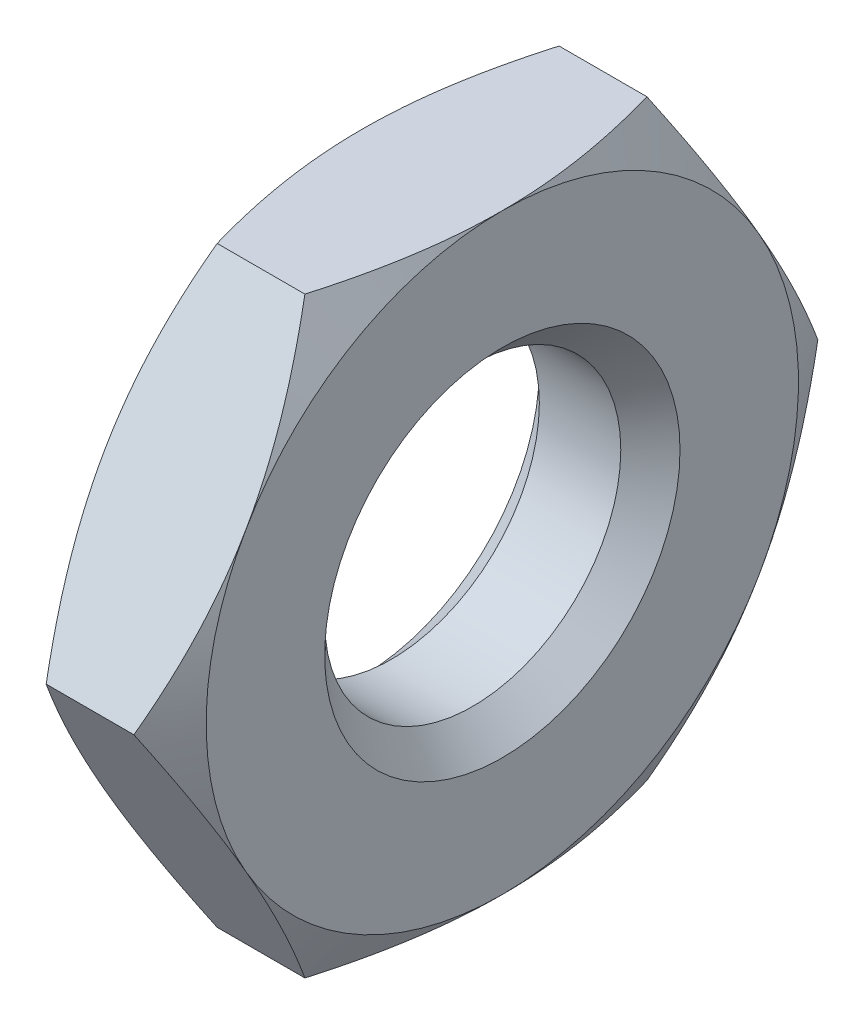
ISO-10303-21;
HEADER;
FILE_DESCRIPTION(('STEP AP214'),'2;1');
FILE_NAME('part.step','',(''),(''),'','','');
FILE_SCHEMA(('AUTOMOTIVE_DESIGN { 1 0 10303 214 1 1 1 1 }'));
ENDSEC;
DATA;
#1=APPLICATION_CONTEXT('core data for automotive mechanical design processes');
#2=APPLICATION_PROTOCOL_DEFINITION('international standard','automotive_design',2000,#1);
#3=PRODUCT_CONTEXT('',#1,'mechanical');
#4=PRODUCT('Part','Part','',(#3));
#5=PRODUCT_RELATED_PRODUCT_CATEGORY('part','',(#4));
#6=PRODUCT_DEFINITION_FORMATION('','',#4);
#7=PRODUCT_DEFINITION_CONTEXT('part definition',#1,'design');
#8=PRODUCT_DEFINITION('design','',#6,#7);
#9=PRODUCT_DEFINITION_SHAPE('','',#8);
#10=(LENGTH_UNIT() NAMED_UNIT(*) SI_UNIT(.MILLI.,.METRE.));
#11=(NAMED_UNIT(*) PLANE_ANGLE_UNIT() SI_UNIT($,.RADIAN.));
#12=(NAMED_UNIT(*) SI_UNIT($,.STERADIAN.) SOLID_ANGLE_UNIT());
#13=UNCERTAINTY_MEASURE_WITH_UNIT(LENGTH_MEASURE(1.E-05),#10,'distance_accuracy_value','');
#14=(GEOMETRIC_REPRESENTATION_CONTEXT(3) GLOBAL_UNCERTAINTY_ASSIGNED_CONTEXT((#13)) GLOBAL_UNIT_ASSIGNED_CONTEXT((#10,
#11,#12)) REPRESENTATION_CONTEXT('',''));
#15=CARTESIAN_POINT('',(0.,0.,0.));
#16=DIRECTION('',(0.,0.,1.));
#17=DIRECTION('',(1.,0.,0.));
#18=AXIS2_PLACEMENT_3D('',#15,#16,#17);
#19=CARTESIAN_POINT('',(0.95,2.,-1.15470053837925));
#20=DIRECTION('',(1.,0.,0.));
#21=DIRECTION('',(0.,0.,-1.));
#22=AXIS2_PLACEMENT_3D('',#19,#20,#21);
#23=PLANE('',#22);
#24=CARTESIAN_POINT('',(0.95,0.,0.));
#25=DIRECTION('',(1.,0.,0.));
#26=DIRECTION('',(0.,0.,-1.));
#27=AXIS2_PLACEMENT_3D('',#24,#25,#26);
#28=CIRCLE('',#27,1.2);
#29=CARTESIAN_POINT('',(0.95,0.,-1.2));
#30=VERTEX_POINT('',#29);
#31=EDGE_CURVE('E11',#30,#30,#28,.F.);
#32=ORIENTED_EDGE('',*,*,#31,.T.);
#33=EDGE_LOOP('',(#32));
#34=FACE_BOUND('',#33,.T.);
#35=CARTESIAN_POINT('',(0.95,0.,0.));
#36=DIRECTION('',(1.,0.,0.));
#37=DIRECTION('',(0.,0.,-1.));
#38=AXIS2_PLACEMENT_3D('',#35,#36,#37);
#39=CIRCLE('',#38,2.);
#40=CARTESIAN_POINT('',(0.95,-2.,0.));
#41=VERTEX_POINT('',#40);
#42=CARTESIAN_POINT('',(0.95,-1.,-1.73205080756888));
#43=VERTEX_POINT('',#42);
#44=EDGE_CURVE('E142',#41,#43,#39,.T.);
#45=ORIENTED_EDGE('',*,*,#44,.T.);
#46=CARTESIAN_POINT('',(0.95,1.,-1.73205080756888));
#47=VERTEX_POINT('',#46);
#48=EDGE_CURVE('E130',#43,#47,#39,.T.);
#49=ORIENTED_EDGE('',*,*,#48,.T.);
#50=CARTESIAN_POINT('',(0.95,2.,0.));
#51=VERTEX_POINT('',#50);
#52=EDGE_CURVE('E144',#47,#51,#39,.T.);
#53=ORIENTED_EDGE('',*,*,#52,.T.);
#54=CARTESIAN_POINT('',(0.95,1.,1.73205080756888));
#55=VERTEX_POINT('',#54);
#56=EDGE_CURVE('E55',#51,#55,#39,.T.);
#57=ORIENTED_EDGE('',*,*,#56,.T.);
#58=CARTESIAN_POINT('',(0.95,-1.,1.73205080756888));
#59=VERTEX_POINT('',#58);
#60=EDGE_CURVE('E63',#55,#59,#39,.T.);
#61=ORIENTED_EDGE('',*,*,#60,.T.);
#62=EDGE_CURVE('E166',#59,#41,#39,.T.);
#63=ORIENTED_EDGE('',*,*,#62,.T.);
#64=EDGE_LOOP('',(#45,#49,#53,#57,#61,#63));
#65=FACE_BOUND('',#64,.T.);
#66=ADVANCED_FACE('F39',(#34,#65),#23,.T.);
#67=CARTESIAN_POINT('',(0.,2.,-1.15470053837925));
#68=DIRECTION('',(1.,0.,0.));
#69=DIRECTION('',(0.,0.,-1.));
#70=AXIS2_PLACEMENT_3D('',#67,#68,#69);
#71=PLANE('',#70);
#72=CARTESIAN_POINT('',(0.,0.,0.));
#73=DIRECTION('',(1.,0.,0.));
#74=DIRECTION('',(0.,0.,-1.));
#75=AXIS2_PLACEMENT_3D('',#72,#73,#74);
#76=CIRCLE('',#75,1.2);
#77=CARTESIAN_POINT('',(0.,0.,-1.2));
#78=VERTEX_POINT('',#77);
#79=EDGE_CURVE('E164',#78,#78,#76,.T.);
#80=ORIENTED_EDGE('',*,*,#79,.T.);
#81=EDGE_LOOP('',(#80));
#82=FACE_BOUND('',#81,.T.);
#83=CARTESIAN_POINT('',(0.,0.,0.));
#84=DIRECTION('',(1.,0.,0.));
#85=DIRECTION('',(0.,0.,-1.));
#86=AXIS2_PLACEMENT_3D('',#83,#84,#85);
#87=CIRCLE('',#86,2.);
#88=CARTESIAN_POINT('',(0.,-1.,-1.73205080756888));
#89=VERTEX_POINT('',#88);
#90=CARTESIAN_POINT('',(0.,1.,-1.73205080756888));
#91=VERTEX_POINT('',#90);
#92=EDGE_CURVE('E173',#89,#91,#87,.T.);
#93=ORIENTED_EDGE('',*,*,#92,.F.);
#94=CARTESIAN_POINT('',(0.,-2.,0.));
#95=VERTEX_POINT('',#94);
#96=EDGE_CURVE('E319',#95,#89,#87,.T.);
#97=ORIENTED_EDGE('',*,*,#96,.F.);
#98=CARTESIAN_POINT('',(0.,-1.,1.73205080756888));
#99=VERTEX_POINT('',#98);
#100=EDGE_CURVE('E322',#99,#95,#87,.T.);
#101=ORIENTED_EDGE('',*,*,#100,.F.);
#102=CARTESIAN_POINT('',(0.,1.,1.73205080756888));
#103=VERTEX_POINT('',#102);
#104=EDGE_CURVE('E327',#103,#99,#87,.T.);
#105=ORIENTED_EDGE('',*,*,#104,.F.);
#106=CARTESIAN_POINT('',(0.,2.,0.));
#107=VERTEX_POINT('',#106);
#108=EDGE_CURVE('E178',#107,#103,#87,.T.);
#109=ORIENTED_EDGE('',*,*,#108,.F.);
#110=EDGE_CURVE('E174',#91,#107,#87,.T.);
#111=ORIENTED_EDGE('',*,*,#110,.F.);
#112=EDGE_LOOP('',(#93,#97,#101,#105,#109,#111));
#113=FACE_BOUND('',#112,.T.);
#114=ADVANCED_FACE('F320',(#82,#113),#71,.F.);
#115=CARTESIAN_POINT('',(0.95,0.,0.));
#116=DIRECTION('',(-1.,0.,0.));
#117=DIRECTION('',(0.,0.,1.));
#118=AXIS2_PLACEMENT_3D('',#115,#116,#117);
#119=CYLINDRICAL_SURFACE('',#118,1.);
#120=CARTESIAN_POINT('',(0.199999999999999,0.,0.));
#121=DIRECTION('',(1.,0.,0.));
#122=DIRECTION('',(0.,0.,-1.));
#123=AXIS2_PLACEMENT_3D('',#120,#121,#122);
#124=CIRCLE('',#123,1.);
#125=CARTESIAN_POINT('',(0.199999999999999,0.,1.));
#126=VERTEX_POINT('',#125);
#127=EDGE_CURVE('E48',#126,#126,#124,.F.);
#128=CARTESIAN_POINT('',(0.749999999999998,0.,0.));
#129=DIRECTION('',(1.,0.,0.));
#130=DIRECTION('',(0.,0.,-1.));
#131=AXIS2_PLACEMENT_3D('',#128,#129,#130);
#132=CIRCLE('',#131,1.);
#133=CARTESIAN_POINT('',(0.749999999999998,0.,1.));
#134=VERTEX_POINT('',#133);
#135=EDGE_CURVE('E391',#134,#134,#132,.T.);
#136=CARTESIAN_POINT('',(0.199999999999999,0.,1.));
#137=CARTESIAN_POINT('',(0.205729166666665,0.,1.));
#138=CARTESIAN_POINT('',(0.211458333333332,0.,1.));
#139=CARTESIAN_POINT('',(0.222916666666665,0.,1.));
#140=CARTESIAN_POINT('',(0.228645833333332,0.,1.));
#141=CARTESIAN_POINT('',(0.240104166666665,0.,1.));
#142=CARTESIAN_POINT('',(0.245833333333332,0.,1.));
#143=CARTESIAN_POINT('',(0.257291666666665,0.,1.));
#144=CARTESIAN_POINT('',(0.263020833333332,0.,1.));
#145=CARTESIAN_POINT('',(0.274479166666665,0.,1.));
#146=CARTESIAN_POINT('',(0.280208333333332,0.,1.));
#147=CARTESIAN_POINT('',(0.291666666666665,0.,1.));
#148=CARTESIAN_POINT('',(0.297395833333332,0.,1.));
#149=CARTESIAN_POINT('',(0.308854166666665,0.,1.));
#150=CARTESIAN_POINT('',(0.314583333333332,0.,1.));
#151=CARTESIAN_POINT('',(0.326041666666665,0.,1.));
#152=CARTESIAN_POINT('',(0.331770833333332,0.,1.));
#153=CARTESIAN_POINT('',(0.343229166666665,0.,1.));
#154=CARTESIAN_POINT('',(0.348958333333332,0.,1.));
#155=CARTESIAN_POINT('',(0.360416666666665,0.,1.));
#156=CARTESIAN_POINT('',(0.366145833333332,0.,1.));
#157=CARTESIAN_POINT('',(0.377604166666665,0.,1.));
#158=CARTESIAN_POINT('',(0.383333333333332,0.,1.));
#159=CARTESIAN_POINT('',(0.394791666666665,0.,1.));
#160=CARTESIAN_POINT('',(0.400520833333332,0.,1.));
#161=CARTESIAN_POINT('',(0.411979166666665,0.,1.));
#162=CARTESIAN_POINT('',(0.417708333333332,0.,1.));
#163=CARTESIAN_POINT('',(0.429166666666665,0.,1.));
#164=CARTESIAN_POINT('',(0.434895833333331,0.,1.));
#165=CARTESIAN_POINT('',(0.446354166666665,0.,1.));
#166=CARTESIAN_POINT('',(0.452083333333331,0.,1.));
#167=CARTESIAN_POINT('',(0.463541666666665,0.,1.));
#168=CARTESIAN_POINT('',(0.469270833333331,0.,1.));
#169=CARTESIAN_POINT('',(0.480729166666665,0.,1.));
#170=CARTESIAN_POINT('',(0.486458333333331,0.,1.));
#171=CARTESIAN_POINT('',(0.497916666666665,0.,1.));
#172=CARTESIAN_POINT('',(0.503645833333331,0.,1.));
#173=CARTESIAN_POINT('',(0.515104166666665,0.,1.));
#174=CARTESIAN_POINT('',(0.520833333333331,0.,1.));
#175=CARTESIAN_POINT('',(0.532291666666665,0.,1.));
#176=CARTESIAN_POINT('',(0.538020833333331,0.,1.));
#177=CARTESIAN_POINT('',(0.549479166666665,0.,1.));
#178=CARTESIAN_POINT('',(0.555208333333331,0.,1.));
#179=CARTESIAN_POINT('',(0.566666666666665,0.,1.));
#180=CARTESIAN_POINT('',(0.572395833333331,0.,1.));
#181=CARTESIAN_POINT('',(0.583854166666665,0.,1.));
#182=CARTESIAN_POINT('',(0.589583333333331,0.,1.));
#183=CARTESIAN_POINT('',(0.601041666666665,0.,1.));
#184=CARTESIAN_POINT('',(0.606770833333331,0.,1.));
#185=CARTESIAN_POINT('',(0.618229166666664,0.,1.));
#186=CARTESIAN_POINT('',(0.623958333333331,0.,1.));
#187=CARTESIAN_POINT('',(0.635416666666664,0.,1.));
#188=CARTESIAN_POINT('',(0.641145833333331,0.,1.));
#189=CARTESIAN_POINT('',(0.652604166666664,0.,1.));
#190=CARTESIAN_POINT('',(0.658333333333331,0.,1.));
#191=CARTESIAN_POINT('',(0.669791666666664,0.,1.));
#192=CARTESIAN_POINT('',(0.675520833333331,0.,1.));
#193=CARTESIAN_POINT('',(0.686979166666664,0.,1.));
#194=CARTESIAN_POINT('',(0.692708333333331,0.,1.));
#195=CARTESIAN_POINT('',(0.704166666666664,0.,1.));
#196=CARTESIAN_POINT('',(0.709895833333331,0.,1.));
#197=CARTESIAN_POINT('',(0.721354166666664,0.,1.));
#198=CARTESIAN_POINT('',(0.727083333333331,0.,1.));
#199=CARTESIAN_POINT('',(0.738541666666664,0.,1.));
#200=CARTESIAN_POINT('',(0.744270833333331,0.,1.));
#201=CARTESIAN_POINT('',(0.749999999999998,0.,1.));
#202=B_SPLINE_CURVE_WITH_KNOTS('',3,(#136,#137,#138,#139,#140,#141,#142,#143,#144,#145,#146,
#147,#148,#149,#150,#151,#152,#153,#154,#155,#156,#157,#158,#159,#160,#161,#162,#163,#164,#165,
#166,#167,#168,#169,#170,#171,#172,#173,#174,#175,#176,#177,#178,#179,#180,#181,#182,#183,#184,
#185,#186,#187,#188,#189,#190,#191,#192,#193,#194,#195,#196,#197,#198,#199,#200,#201),
.UNSPECIFIED.,.F.,.F.,(4,2,2,2,2,2,2,2,2,2,2,2,2,2,2,2,2,2,2,2,2,2,2,2,2,2,2,2,2,2,2,2,4),(0.,
0.0171874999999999,0.0343749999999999,0.0515625,0.0687499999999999,0.0859374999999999,0.103125,
0.1203125,0.1375,0.1546875,0.171875,0.1890625,0.20625,0.2234375,0.240625,0.2578125,
0.274999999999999,0.292187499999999,0.309374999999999,0.326562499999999,0.343749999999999,
0.360937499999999,0.378124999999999,0.395312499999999,0.412499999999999,0.429687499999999,
0.446874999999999,0.464062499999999,0.481249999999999,0.498437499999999,0.515624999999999,
0.532812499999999,0.549999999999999),.UNSPECIFIED.);
#203=EDGE_CURVE('BSEAM234',#126,#134,#202,.T.);
#204=ORIENTED_EDGE('',*,*,#127,.T.);
#205=ORIENTED_EDGE('',*,*,#135,.T.);
#206=ORIENTED_EDGE('',*,*,#203,.T.);
#207=ORIENTED_EDGE('',*,*,#203,.F.);
#208=EDGE_LOOP('',(#204,#206,#205,#207));
#209=FACE_BOUND('',#208,.T.);
#210=ADVANCED_FACE('F234',(#209),#119,.F.);
#211=CARTESIAN_POINT('',(0.,0.,0.));
#212=DIRECTION('',(1.,0.,0.));
#213=DIRECTION('',(0.,0.,-1.));
#214=AXIS2_PLACEMENT_3D('',#211,#212,#213);
#215=CONICAL_SURFACE('',#214,2.,1.0471975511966);
#216=CARTESIAN_POINT('',(0.178699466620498,-2.0002,-1.15458506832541));
#217=CARTESIAN_POINT('',(0.149389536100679,-1.91230873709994,-1.20532911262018));
#218=CARTESIAN_POINT('',(0.122732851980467,-1.82365880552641,-1.2565111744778));
#219=CARTESIAN_POINT('',(0.0762024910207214,-1.6448237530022,-1.35976164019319));
#220=CARTESIAN_POINT('',(0.0563452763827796,-1.55463545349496,-1.41183187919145));
#221=CARTESIAN_POINT('',(0.0254334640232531,-1.37537661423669,-1.51532701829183));
#222=CARTESIAN_POINT('',(0.0141731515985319,-1.2863336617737,-1.56673599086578));
#223=CARTESIAN_POINT('',(0.000728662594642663,-1.10782860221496,-1.66979593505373));
#224=CARTESIAN_POINT('',(-0.00146664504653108,-1.01836714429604,-1.72144653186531));
#225=CARTESIAN_POINT('',(0.0030909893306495,-0.851191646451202,-1.81796535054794));
#226=CARTESIAN_POINT('',(0.00872487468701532,-0.773452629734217,-1.86284799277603));
#227=CARTESIAN_POINT('',(0.0265838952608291,-0.618481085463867,-1.95232085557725));
#228=CARTESIAN_POINT('',(0.03881513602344,-0.541249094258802,-1.99691076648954));
#229=CARTESIAN_POINT('',(0.0693934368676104,-0.3859578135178,-2.08656822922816));
#230=CARTESIAN_POINT('',(0.0878701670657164,-0.307918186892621,-2.13162442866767));
#231=CARTESIAN_POINT('',(0.129805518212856,-0.153003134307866,-2.221064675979));
#232=CARTESIAN_POINT('',(0.153254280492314,-0.0761257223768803,-2.26544987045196));
#233=CARTESIAN_POINT('',(0.178699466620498,0.000199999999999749,-2.30951654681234));
#234=B_SPLINE_CURVE_WITH_KNOTS('',3,(#216,#217,#218,#219,#220,#221,#222,#223,#224,#225,#226,
#227,#228,#229,#230,#231,#232,#233),.UNSPECIFIED.,.F.,.F.,(4,2,2,2,2,2,2,2,4),(0.,
0.31703182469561,0.634825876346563,0.944753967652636,1.25430138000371,1.52387047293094,
1.79368946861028,2.06949491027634,2.34475850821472),.UNSPECIFIED.);
#235=CARTESIAN_POINT('',(0.178632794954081,0.,-2.3094010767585));
#236=VERTEX_POINT('',#235);
#237=EDGE_CURVE('E333',#89,#236,#234,.T.);
#238=ORIENTED_EDGE('',*,*,#237,.F.);
#239=ORIENTED_EDGE('',*,*,#92,.T.);
#240=CARTESIAN_POINT('',(0.178699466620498,-0.000200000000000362,-2.30951654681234));
#241=CARTESIAN_POINT('',(0.149389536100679,0.0876912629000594,-2.25877250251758));
#242=CARTESIAN_POINT('',(0.122732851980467,0.176341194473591,-2.20759044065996));
#243=CARTESIAN_POINT('',(0.0762024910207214,0.355176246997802,-2.10433997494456));
#244=CARTESIAN_POINT('',(0.0563452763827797,0.445364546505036,-2.05226973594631));
#245=CARTESIAN_POINT('',(0.0254334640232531,0.624623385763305,-1.94877459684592));
#246=CARTESIAN_POINT('',(0.0141731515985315,0.713666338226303,-1.89736562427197));
#247=CARTESIAN_POINT('',(0.000728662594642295,0.892171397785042,-1.79430568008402));
#248=CARTESIAN_POINT('',(-0.0014666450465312,0.981632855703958,-1.74265508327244));
#249=CARTESIAN_POINT('',(0.00309098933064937,1.1488083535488,-1.64613626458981));
#250=CARTESIAN_POINT('',(0.00872487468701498,1.22654737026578,-1.60125362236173));
#251=CARTESIAN_POINT('',(0.0265838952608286,1.38151891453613,-1.51178075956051));
#252=CARTESIAN_POINT('',(0.0388151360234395,1.4587509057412,-1.46719084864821));
#253=CARTESIAN_POINT('',(0.0693934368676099,1.6140421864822,-1.37753338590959));
#254=CARTESIAN_POINT('',(0.087870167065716,1.69208181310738,-1.33247718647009));
#255=CARTESIAN_POINT('',(0.129805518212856,1.84699686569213,-1.24303693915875));
#256=CARTESIAN_POINT('',(0.153254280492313,1.92387427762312,-1.1986517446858));
#257=CARTESIAN_POINT('',(0.178699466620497,2.0002,-1.15458506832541));
#258=B_SPLINE_CURVE_WITH_KNOTS('',3,(#240,#241,#242,#243,#244,#245,#246,#247,#248,#249,#250,
#251,#252,#253,#254,#255,#256,#257),.UNSPECIFIED.,.F.,.F.,(4,2,2,2,2,2,2,2,4),(0.,
0.31703182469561,0.634825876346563,0.944753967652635,1.25430138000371,1.52387047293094,
1.79368946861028,2.06949491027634,2.34475850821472),.UNSPECIFIED.);
#259=EDGE_CURVE('E215',#236,#91,#258,.T.);
#260=ORIENTED_EDGE('',*,*,#259,.F.);
#261=EDGE_LOOP('',(#238,#239,#260));
#262=FACE_BOUND('',#261,.T.);
#263=ADVANCED_FACE('F194',(#262),#215,.T.);
#264=ORIENTED_EDGE('',*,*,#96,.T.);
#265=CARTESIAN_POINT('',(0.178632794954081,-2.,-1.15470053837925));
#266=VERTEX_POINT('',#265);
#267=EDGE_CURVE('E156',#266,#89,#234,.T.);
#268=ORIENTED_EDGE('',*,*,#267,.F.);
#269=CARTESIAN_POINT('',(0.977056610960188,-2.,-3.10373414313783));
#270=CARTESIAN_POINT('',(0.934666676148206,-2.,-3.01636549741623));
#271=CARTESIAN_POINT('',(0.892682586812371,-2.,-2.92879651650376));
#272=CARTESIAN_POINT('',(0.809754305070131,-2.,-2.75315136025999));
#273=CARTESIAN_POINT('',(0.768810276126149,-2.,-2.66507510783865));
#274=CARTESIAN_POINT('',(0.687984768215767,-2.,-2.48785606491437));
#275=CARTESIAN_POINT('',(0.64811026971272,-2.,-2.39871007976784));
#276=CARTESIAN_POINT('',(0.569990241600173,-2.,-2.2197098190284));
#277=CARTESIAN_POINT('',(0.531744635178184,-2.,-2.12985557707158));
#278=CARTESIAN_POINT('',(0.456111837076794,-2.,-1.9463836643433));
#279=CARTESIAN_POINT('',(0.418792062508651,-2.,-1.85273804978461));
#280=CARTESIAN_POINT('',(0.34697201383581,-2.,-1.66435196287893));
#281=CARTESIAN_POINT('',(0.312472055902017,-2.,-1.56961136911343));
#282=CARTESIAN_POINT('',(0.247195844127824,-2.,-1.37906128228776));
#283=CARTESIAN_POINT('',(0.21641206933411,-2.,-1.28325439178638));
#284=CARTESIAN_POINT('',(0.159554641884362,-2.,-1.09026629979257));
#285=CARTESIAN_POINT('',(0.133479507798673,-2.,-0.99308554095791));
#286=CARTESIAN_POINT('',(0.0874290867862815,-2.,-0.797836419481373));
#287=CARTESIAN_POINT('',(0.0674205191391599,-2.,-0.699776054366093));
#288=CARTESIAN_POINT('',(0.0346309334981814,-2.,-0.502434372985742));
#289=CARTESIAN_POINT('',(0.0218492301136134,-2.,-0.403153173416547));
#290=CARTESIAN_POINT('',(0.00470361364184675,-2.,-0.205159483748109));
#291=CARTESIAN_POINT('',(0.00023134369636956,-2.,-0.106456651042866));
#292=CARTESIAN_POINT('',(-0.000214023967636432,-2.,0.0909650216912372));
#293=CARTESIAN_POINT('',(0.00381302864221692,-2.,0.189683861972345));
#294=CARTESIAN_POINT('',(0.0233093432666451,-2.,0.426399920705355));
#295=CARTESIAN_POINT('',(0.0427604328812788,-2.,0.564071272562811));
#296=CARTESIAN_POINT('',(0.0947931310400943,-2.,0.83691456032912));
#297=CARTESIAN_POINT('',(0.127387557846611,-2.,0.972083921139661));
#298=CARTESIAN_POINT('',(0.202969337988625,-2.,1.24263360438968));
#299=CARTESIAN_POINT('',(0.246170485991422,-2.,1.37795255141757));
#300=CARTESIAN_POINT('',(0.339526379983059,-2.,1.64608056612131));
#301=CARTESIAN_POINT('',(0.389679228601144,-2.,1.77889030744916));
#302=CARTESIAN_POINT('',(0.477777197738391,-2.,1.99976727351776));
#303=CARTESIAN_POINT('',(0.514402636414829,-2.,2.08836858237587));
#304=CARTESIAN_POINT('',(0.589419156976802,-2.,2.26482232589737));
#305=CARTESIAN_POINT('',(0.62781028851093,-2.,2.35267473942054));
#306=CARTESIAN_POINT('',(0.745086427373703,-2.,2.61533353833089));
#307=CARTESIAN_POINT('',(0.826059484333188,-2.,2.7892055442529));
#308=CARTESIAN_POINT('',(0.991710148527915,-2.,3.13537157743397));
#309=CARTESIAN_POINT('',(1.07639139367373,-2.,3.30766384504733));
#310=CARTESIAN_POINT('',(1.24824982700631,-2.,3.65100298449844));
#311=CARTESIAN_POINT('',(1.33542709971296,-2.,3.82204981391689));
#312=CARTESIAN_POINT('',(1.50424513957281,-2.,4.14908007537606));
#313=CARTESIAN_POINT('',(1.5857454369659,-2.,4.30513626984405));
#314=CARTESIAN_POINT('',(1.74986684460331,-2.,4.61666441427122));
#315=CARTESIAN_POINT('',(1.83248799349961,-2.,4.77213634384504));
#316=CARTESIAN_POINT('',(1.99838092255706,-2.,5.08224069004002));
#317=CARTESIAN_POINT('',(2.08165060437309,-2.,5.23687423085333));
#318=CARTESIAN_POINT('',(2.2488617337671,-2.,5.54576693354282));
#319=CARTESIAN_POINT('',(2.33280314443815,-2.,5.70002611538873));
#320=CARTESIAN_POINT('',(2.41699558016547,-2.,5.8541472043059));
#321=B_SPLINE_CURVE_WITH_KNOTS('',3,(#269,#270,#271,#272,#273,#274,#275,#276,#277,#278,#279,
#280,#281,#282,#283,#284,#285,#286,#287,#288,#289,#290,#291,#292,#293,#294,#295,#296,#297,#298,
#299,#300,#301,#302,#303,#304,#305,#306,#307,#308,#309,#310,#311,#312,#313,#314,#315,#316,#317,
#318,#319,#320),.UNSPECIFIED.,.F.,.F.,(4,2,2,2,2,2,2,2,2,2,2,2,2,2,2,2,2,2,2,2,2,2,2,2,2,4),(0.,
0.291330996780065,0.582707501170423,0.875666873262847,1.16861241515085,1.47100152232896,
1.77342448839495,2.07522475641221,2.37692990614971,2.67694866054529,2.97693895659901,
3.27298908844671,3.56904445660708,3.9853017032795,4.40196589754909,4.82783978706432,
5.25359766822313,5.54119749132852,5.82880540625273,6.40413765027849,6.98004755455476,
7.55597698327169,8.08414067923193,8.61232263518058,9.1392063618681,9.66606133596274),.UNSPECIFIED.);
#322=EDGE_CURVE('E177',#95,#266,#321,.F.);
#323=ORIENTED_EDGE('',*,*,#322,.F.);
#324=EDGE_LOOP('',(#264,#268,#323));
#325=FACE_BOUND('',#324,.T.);
#326=ADVANCED_FACE('F350',(#325),#215,.T.);
#327=CARTESIAN_POINT('',(0.475,0.,0.));
#328=DIRECTION('',(-1.,0.,0.));
#329=DIRECTION('',(0.,0.,1.));
#330=AXIS2_PLACEMENT_3D('',#327,#328,#329);
#331=CONICAL_SURFACE('',#330,2.82272413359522,1.0471975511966);
#332=CARTESIAN_POINT('',(0.771300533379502,0.000199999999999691,-2.30951654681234));
#333=CARTESIAN_POINT('',(0.800610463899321,-0.0876912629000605,-2.25877250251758));
#334=CARTESIAN_POINT('',(0.827267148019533,-0.176341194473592,-2.20759044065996));
#335=CARTESIAN_POINT('',(0.873797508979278,-0.355176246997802,-2.10433997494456));
#336=CARTESIAN_POINT('',(0.89365472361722,-0.445364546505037,-2.05226973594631));
#337=CARTESIAN_POINT('',(0.924566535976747,-0.624623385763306,-1.94877459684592));
#338=CARTESIAN_POINT('',(0.935826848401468,-0.713666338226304,-1.89736562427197));
#339=CARTESIAN_POINT('',(0.949271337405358,-0.892171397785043,-1.79430568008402));
#340=CARTESIAN_POINT('',(0.951466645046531,-0.981632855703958,-1.74265508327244));
#341=CARTESIAN_POINT('',(0.94690901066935,-1.1488083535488,-1.64613626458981));
#342=CARTESIAN_POINT('',(0.941275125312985,-1.22654737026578,-1.60125362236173));
#343=CARTESIAN_POINT('',(0.923416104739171,-1.38151891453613,-1.51178075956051));
#344=CARTESIAN_POINT('',(0.91118486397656,-1.4587509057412,-1.46719084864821));
#345=CARTESIAN_POINT('',(0.88060656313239,-1.6140421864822,-1.37753338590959));
#346=CARTESIAN_POINT('',(0.862129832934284,-1.69208181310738,-1.33247718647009));
#347=CARTESIAN_POINT('',(0.820194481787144,-1.84699686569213,-1.24303693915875));
#348=CARTESIAN_POINT('',(0.796745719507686,-1.92387427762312,-1.1986517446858));
#349=CARTESIAN_POINT('',(0.771300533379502,-2.0002,-1.15458506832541));
#350=B_SPLINE_CURVE_WITH_KNOTS('',3,(#332,#333,#334,#335,#336,#337,#338,#339,#340,#341,#342,
#343,#344,#345,#346,#347,#348,#349),.UNSPECIFIED.,.F.,.F.,(4,2,2,2,2,2,2,2,4),(0.,
0.31703182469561,0.634825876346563,0.944753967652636,1.25430138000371,1.52387047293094,
1.79368946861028,2.06949491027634,2.34475850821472),.UNSPECIFIED.);
#351=CARTESIAN_POINT('',(0.771367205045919,-2.,-1.15470053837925));
#352=VERTEX_POINT('',#351);
#353=EDGE_CURVE('E147',#43,#352,#350,.T.);
#354=ORIENTED_EDGE('',*,*,#353,.F.);
#355=ORIENTED_EDGE('',*,*,#44,.F.);
#356=CARTESIAN_POINT('',(-0.0270566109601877,-2.,-3.10373414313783));
#357=CARTESIAN_POINT('',(0.0153333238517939,-2.,-3.01636549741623));
#358=CARTESIAN_POINT('',(0.0573174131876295,-2.,-2.92879651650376));
#359=CARTESIAN_POINT('',(0.140245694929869,-2.,-2.75315136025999));
#360=CARTESIAN_POINT('',(0.181189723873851,-2.,-2.66507510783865));
#361=CARTESIAN_POINT('',(0.262015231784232,-2.,-2.48785606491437));
#362=CARTESIAN_POINT('',(0.30188973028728,-2.,-2.39871007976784));
#363=CARTESIAN_POINT('',(0.380009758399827,-2.,-2.2197098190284));
#364=CARTESIAN_POINT('',(0.418255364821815,-2.,-2.12985557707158));
#365=CARTESIAN_POINT('',(0.493888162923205,-2.,-1.9463836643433));
#366=CARTESIAN_POINT('',(0.531207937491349,-2.,-1.85273804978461));
#367=CARTESIAN_POINT('',(0.60302798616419,-2.,-1.66435196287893));
#368=CARTESIAN_POINT('',(0.637527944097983,-2.,-1.56961136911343));
#369=CARTESIAN_POINT('',(0.702804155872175,-2.,-1.37906128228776));
#370=CARTESIAN_POINT('',(0.733587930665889,-2.,-1.28325439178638));
#371=CARTESIAN_POINT('',(0.790445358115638,-2.,-1.09026629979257));
#372=CARTESIAN_POINT('',(0.816520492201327,-2.,-0.99308554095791));
#373=CARTESIAN_POINT('',(0.862570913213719,-2.,-0.797836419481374));
#374=CARTESIAN_POINT('',(0.88257948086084,-2.,-0.699776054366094));
#375=CARTESIAN_POINT('',(0.915369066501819,-2.,-0.502434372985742));
#376=CARTESIAN_POINT('',(0.928150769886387,-2.,-0.403153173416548));
#377=CARTESIAN_POINT('',(0.945296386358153,-2.,-0.205159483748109));
#378=CARTESIAN_POINT('',(0.94976865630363,-2.,-0.106456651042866));
#379=CARTESIAN_POINT('',(0.950214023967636,-2.,0.0909650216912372));
#380=CARTESIAN_POINT('',(0.946186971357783,-2.,0.189683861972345));
#381=CARTESIAN_POINT('',(0.926690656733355,-2.,0.426399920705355));
#382=CARTESIAN_POINT('',(0.907239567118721,-2.,0.564071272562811));
#383=CARTESIAN_POINT('',(0.855206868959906,-2.,0.83691456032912));
#384=CARTESIAN_POINT('',(0.822612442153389,-2.,0.972083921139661));
#385=CARTESIAN_POINT('',(0.747030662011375,-2.,1.24263360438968));
#386=CARTESIAN_POINT('',(0.703829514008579,-2.,1.37795255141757));
#387=CARTESIAN_POINT('',(0.610473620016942,-2.,1.64608056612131));
#388=CARTESIAN_POINT('',(0.560320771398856,-2.,1.77889030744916));
#389=CARTESIAN_POINT('',(0.472222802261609,-2.,1.99976727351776));
#390=CARTESIAN_POINT('',(0.435597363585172,-2.,2.08836858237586));
#391=CARTESIAN_POINT('',(0.360580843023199,-2.,2.26482232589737));
#392=CARTESIAN_POINT('',(0.322189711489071,-2.,2.35267473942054));
#393=CARTESIAN_POINT('',(0.204913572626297,-2.,2.61533353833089));
#394=CARTESIAN_POINT('',(0.123940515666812,-2.,2.7892055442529));
#395=CARTESIAN_POINT('',(-0.0417101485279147,-2.,3.13537157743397));
#396=CARTESIAN_POINT('',(-0.126391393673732,-2.,3.30766384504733));
#397=CARTESIAN_POINT('',(-0.298249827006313,-2.,3.65100298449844));
#398=CARTESIAN_POINT('',(-0.385427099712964,-2.,3.82204981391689));
#399=CARTESIAN_POINT('',(-0.554245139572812,-2.,4.14908007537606));
#400=CARTESIAN_POINT('',(-0.635745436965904,-2.,4.30513626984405));
#401=CARTESIAN_POINT('',(-0.799866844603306,-2.,4.61666441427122));
#402=CARTESIAN_POINT('',(-0.882487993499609,-2.,4.77213634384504));
#403=CARTESIAN_POINT('',(-1.04838092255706,-2.,5.08224069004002));
#404=CARTESIAN_POINT('',(-1.13165060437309,-2.,5.23687423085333));
#405=CARTESIAN_POINT('',(-1.2988617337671,-2.,5.54576693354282));
#406=CARTESIAN_POINT('',(-1.38280314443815,-2.,5.70002611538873));
#407=CARTESIAN_POINT('',(-1.46699558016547,-2.,5.8541472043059));
#408=B_SPLINE_CURVE_WITH_KNOTS('',3,(#356,#357,#358,#359,#360,#361,#362,#363,#364,#365,#366,
#367,#368,#369,#370,#371,#372,#373,#374,#375,#376,#377,#378,#379,#380,#381,#382,#383,#384,#385,
#386,#387,#388,#389,#390,#391,#392,#393,#394,#395,#396,#397,#398,#399,#400,#401,#402,#403,#404,
#405,#406,#407),.UNSPECIFIED.,.F.,.F.,(4,2,2,2,2,2,2,2,2,2,2,2,2,2,2,2,2,2,2,2,2,2,2,2,2,4),(0.,
0.291330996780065,0.582707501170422,0.875666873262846,1.16861241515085,1.47100152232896,
1.77342448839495,2.07522475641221,2.37692990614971,2.67694866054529,2.97693895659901,
3.27298908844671,3.56904445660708,3.9853017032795,4.40196589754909,4.82783978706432,
5.25359766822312,5.54119749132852,5.82880540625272,6.40413765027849,6.98004755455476,
7.55597698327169,8.08414067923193,8.61232263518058,9.1392063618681,9.66606133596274),.UNSPECIFIED.);
#409=EDGE_CURVE('E151',#352,#41,#408,.T.);
#410=ORIENTED_EDGE('',*,*,#409,.F.);
#411=EDGE_LOOP('',(#354,#355,#410));
#412=FACE_BOUND('',#411,.T.);
#413=ADVANCED_FACE('F148',(#412),#331,.T.);
#414=ORIENTED_EDGE('',*,*,#48,.F.);
#415=CARTESIAN_POINT('',(0.771367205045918,0.,-2.3094010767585));
#416=VERTEX_POINT('',#415);
#417=EDGE_CURVE('E134',#416,#43,#350,.T.);
#418=ORIENTED_EDGE('',*,*,#417,.F.);
#419=CARTESIAN_POINT('',(0.771300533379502,2.0002,-1.15458506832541));
#420=CARTESIAN_POINT('',(0.800610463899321,1.91230873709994,-1.20532911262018));
#421=CARTESIAN_POINT('',(0.827267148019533,1.82365880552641,-1.2565111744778));
#422=CARTESIAN_POINT('',(0.873797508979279,1.6448237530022,-1.35976164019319));
#423=CARTESIAN_POINT('',(0.893654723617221,1.55463545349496,-1.41183187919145));
#424=CARTESIAN_POINT('',(0.924566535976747,1.37537661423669,-1.51532701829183));
#425=CARTESIAN_POINT('',(0.935826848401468,1.2863336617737,-1.56673599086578));
#426=CARTESIAN_POINT('',(0.949271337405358,1.10782860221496,-1.66979593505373));
#427=CARTESIAN_POINT('',(0.951466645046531,1.01836714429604,-1.72144653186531));
#428=CARTESIAN_POINT('',(0.946909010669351,0.851191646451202,-1.81796535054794));
#429=CARTESIAN_POINT('',(0.941275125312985,0.773452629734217,-1.86284799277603));
#430=CARTESIAN_POINT('',(0.923416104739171,0.618481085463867,-1.95232085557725));
#431=CARTESIAN_POINT('',(0.91118486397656,0.541249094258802,-1.99691076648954));
#432=CARTESIAN_POINT('',(0.88060656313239,0.385957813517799,-2.08656822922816));
#433=CARTESIAN_POINT('',(0.862129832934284,0.307918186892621,-2.13162442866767));
#434=CARTESIAN_POINT('',(0.820194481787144,0.153003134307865,-2.221064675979));
#435=CARTESIAN_POINT('',(0.796745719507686,0.0761257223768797,-2.26544987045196));
#436=CARTESIAN_POINT('',(0.771300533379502,-0.00020000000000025,-2.30951654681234));
#437=B_SPLINE_CURVE_WITH_KNOTS('',3,(#419,#420,#421,#422,#423,#424,#425,#426,#427,#428,#429,
#430,#431,#432,#433,#434,#435,#436),.UNSPECIFIED.,.F.,.F.,(4,2,2,2,2,2,2,2,4),(0.,
0.31703182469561,0.634825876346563,0.944753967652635,1.25430138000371,1.52387047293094,
1.79368946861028,2.06949491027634,2.34475850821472),.UNSPECIFIED.);
#438=EDGE_CURVE('E136',#47,#416,#437,.T.);
#439=ORIENTED_EDGE('',*,*,#438,.F.);
#440=EDGE_LOOP('',(#414,#418,#439));
#441=FACE_BOUND('',#440,.T.);
#442=ADVANCED_FACE('F132',(#441),#331,.T.);
#443=ORIENTED_EDGE('',*,*,#100,.T.);
#444=CARTESIAN_POINT('',(0.178632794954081,-2.,1.15470053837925));
#445=VERTEX_POINT('',#444);
#446=EDGE_CURVE('E187',#445,#95,#321,.F.);
#447=ORIENTED_EDGE('',*,*,#446,.F.);
#448=CARTESIAN_POINT('',(0.178699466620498,0.00020000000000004,2.30951654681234));
#449=CARTESIAN_POINT('',(0.149389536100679,-0.0876912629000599,2.25877250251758));
#450=CARTESIAN_POINT('',(0.122732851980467,-0.176341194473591,2.20759044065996));
#451=CARTESIAN_POINT('',(0.0762024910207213,-0.355176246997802,2.10433997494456));
#452=CARTESIAN_POINT('',(0.0563452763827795,-0.445364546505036,2.0522697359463));
#453=CARTESIAN_POINT('',(0.0254334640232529,-0.624623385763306,1.94877459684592));
#454=CARTESIAN_POINT('',(0.0141731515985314,-0.713666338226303,1.89736562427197));
#455=CARTESIAN_POINT('',(0.000728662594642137,-0.892171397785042,1.79430568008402));
#456=CARTESIAN_POINT('',(-0.00146664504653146,-0.981632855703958,1.74265508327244));
#457=CARTESIAN_POINT('',(0.00309098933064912,-1.1488083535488,1.64613626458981));
#458=CARTESIAN_POINT('',(0.00872487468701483,-1.22654737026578,1.60125362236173));
#459=CARTESIAN_POINT('',(0.0265838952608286,-1.38151891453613,1.51178075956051));
#460=CARTESIAN_POINT('',(0.0388151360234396,-1.4587509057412,1.46719084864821));
#461=CARTESIAN_POINT('',(0.06939343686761,-1.6140421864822,1.37753338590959));
#462=CARTESIAN_POINT('',(0.0878701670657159,-1.69208181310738,1.33247718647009));
#463=CARTESIAN_POINT('',(0.129805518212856,-1.84699686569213,1.24303693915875));
#464=CARTESIAN_POINT('',(0.153254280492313,-1.92387427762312,1.1986517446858));
#465=CARTESIAN_POINT('',(0.178699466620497,-2.0002,1.15458506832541));
#466=B_SPLINE_CURVE_WITH_KNOTS('',3,(#448,#449,#450,#451,#452,#453,#454,#455,#456,#457,#458,
#459,#460,#461,#462,#463,#464,#465),.UNSPECIFIED.,.F.,.F.,(4,2,2,2,2,2,2,2,4),(0.,
0.31703182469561,0.634825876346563,0.944753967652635,1.25430138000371,1.52387047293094,
1.79368946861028,2.06949491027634,2.34475850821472),.UNSPECIFIED.);
#467=EDGE_CURVE('E188',#99,#445,#466,.T.);
#468=ORIENTED_EDGE('',*,*,#467,.F.);
#469=EDGE_LOOP('',(#443,#447,#468));
#470=FACE_BOUND('',#469,.T.);
#471=ADVANCED_FACE('F349',(#470),#215,.T.);
#472=CARTESIAN_POINT('',(0.771367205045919,-2.,1.15470053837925));
#473=VERTEX_POINT('',#472);
#474=EDGE_CURVE('E216',#41,#473,#408,.T.);
#475=ORIENTED_EDGE('',*,*,#474,.F.);
#476=ORIENTED_EDGE('',*,*,#62,.F.);
#477=CARTESIAN_POINT('',(0.771300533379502,-2.0002,1.15458506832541));
#478=CARTESIAN_POINT('',(0.800610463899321,-1.91230873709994,1.20532911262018));
#479=CARTESIAN_POINT('',(0.827267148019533,-1.82365880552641,1.2565111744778));
#480=CARTESIAN_POINT('',(0.873797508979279,-1.6448237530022,1.35976164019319));
#481=CARTESIAN_POINT('',(0.893654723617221,-1.55463545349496,1.41183187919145));
#482=CARTESIAN_POINT('',(0.924566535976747,-1.37537661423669,1.51532701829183));
#483=CARTESIAN_POINT('',(0.935826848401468,-1.2863336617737,1.56673599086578));
#484=CARTESIAN_POINT('',(0.949271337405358,-1.10782860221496,1.66979593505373));
#485=CARTESIAN_POINT('',(0.951466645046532,-1.01836714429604,1.72144653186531));
#486=CARTESIAN_POINT('',(0.946909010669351,-0.851191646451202,1.81796535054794));
#487=CARTESIAN_POINT('',(0.941275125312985,-0.773452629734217,1.86284799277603));
#488=CARTESIAN_POINT('',(0.923416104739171,-0.618481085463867,1.95232085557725));
#489=CARTESIAN_POINT('',(0.91118486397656,-0.541249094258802,1.99691076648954));
#490=CARTESIAN_POINT('',(0.88060656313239,-0.385957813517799,2.08656822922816));
#491=CARTESIAN_POINT('',(0.862129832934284,-0.307918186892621,2.13162442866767));
#492=CARTESIAN_POINT('',(0.820194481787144,-0.153003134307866,2.221064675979));
#493=CARTESIAN_POINT('',(0.796745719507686,-0.0761257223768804,2.26544987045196));
#494=CARTESIAN_POINT('',(0.771300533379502,0.00019999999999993,2.30951654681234));
#495=B_SPLINE_CURVE_WITH_KNOTS('',3,(#477,#478,#479,#480,#481,#482,#483,#484,#485,#486,#487,
#488,#489,#490,#491,#492,#493,#494),.UNSPECIFIED.,.F.,.F.,(4,2,2,2,2,2,2,2,4),(0.,
0.31703182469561,0.634825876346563,0.944753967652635,1.25430138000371,1.52387047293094,
1.79368946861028,2.06949491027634,2.34475850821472),.UNSPECIFIED.);
#496=EDGE_CURVE('E247',#473,#59,#495,.T.);
#497=ORIENTED_EDGE('',*,*,#496,.F.);
#498=EDGE_LOOP('',(#475,#476,#497));
#499=FACE_BOUND('',#498,.T.);
#500=ADVANCED_FACE('F429',(#499),#331,.T.);
#501=ORIENTED_EDGE('',*,*,#104,.T.);
#502=CARTESIAN_POINT('',(0.178632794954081,0.,2.3094010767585));
#503=VERTEX_POINT('',#502);
#504=EDGE_CURVE('E286',#503,#99,#466,.T.);
#505=ORIENTED_EDGE('',*,*,#504,.F.);
#506=CARTESIAN_POINT('',(0.178699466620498,2.0002,1.15458506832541));
#507=CARTESIAN_POINT('',(0.149389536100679,1.91230873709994,1.20532911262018));
#508=CARTESIAN_POINT('',(0.122732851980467,1.82365880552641,1.2565111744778));
#509=CARTESIAN_POINT('',(0.0762024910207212,1.6448237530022,1.35976164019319));
#510=CARTESIAN_POINT('',(0.0563452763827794,1.55463545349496,1.41183187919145));
#511=CARTESIAN_POINT('',(0.0254334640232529,1.37537661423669,1.51532701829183));
#512=CARTESIAN_POINT('',(0.0141731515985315,1.2863336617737,1.56673599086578));
#513=CARTESIAN_POINT('',(0.00072866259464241,1.10782860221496,1.66979593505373));
#514=CARTESIAN_POINT('',(-0.00146664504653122,1.01836714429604,1.72144653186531));
#515=CARTESIAN_POINT('',(0.00309098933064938,0.851191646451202,1.81796535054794));
#516=CARTESIAN_POINT('',(0.00872487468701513,0.773452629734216,1.86284799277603));
#517=CARTESIAN_POINT('',(0.0265838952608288,0.618481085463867,1.95232085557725));
#518=CARTESIAN_POINT('',(0.0388151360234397,0.541249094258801,1.99691076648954));
#519=CARTESIAN_POINT('',(0.0693934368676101,0.385957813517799,2.08656822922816));
#520=CARTESIAN_POINT('',(0.0878701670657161,0.30791818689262,2.13162442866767));
#521=CARTESIAN_POINT('',(0.129805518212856,0.153003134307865,2.221064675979));
#522=CARTESIAN_POINT('',(0.153254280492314,0.0761257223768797,2.26544987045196));
#523=CARTESIAN_POINT('',(0.178699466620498,-0.000200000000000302,2.30951654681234));
#524=B_SPLINE_CURVE_WITH_KNOTS('',3,(#506,#507,#508,#509,#510,#511,#512,#513,#514,#515,#516,
#517,#518,#519,#520,#521,#522,#523),.UNSPECIFIED.,.F.,.F.,(4,2,2,2,2,2,2,2,4),(0.,
0.31703182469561,0.634825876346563,0.944753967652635,1.25430138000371,1.52387047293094,
1.79368946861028,2.06949491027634,2.34475850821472),.UNSPECIFIED.);
#525=EDGE_CURVE('E281',#103,#503,#524,.T.);
#526=ORIENTED_EDGE('',*,*,#525,.F.);
#527=EDGE_LOOP('',(#501,#505,#526));
#528=FACE_BOUND('',#527,.T.);
#529=ADVANCED_FACE('F232',(#528),#215,.T.);
#530=CARTESIAN_POINT('',(0.771367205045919,0.,2.3094010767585));
#531=VERTEX_POINT('',#530);
#532=EDGE_CURVE('E375',#59,#531,#495,.T.);
#533=ORIENTED_EDGE('',*,*,#532,.F.);
#534=ORIENTED_EDGE('',*,*,#60,.F.);
#535=CARTESIAN_POINT('',(0.771300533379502,-0.000200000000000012,2.30951654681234));
#536=CARTESIAN_POINT('',(0.800610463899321,0.0876912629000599,2.25877250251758));
#537=CARTESIAN_POINT('',(0.827267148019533,0.176341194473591,2.20759044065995));
#538=CARTESIAN_POINT('',(0.873797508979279,0.355176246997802,2.10433997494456));
#539=CARTESIAN_POINT('',(0.893654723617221,0.445364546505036,2.0522697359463));
#540=CARTESIAN_POINT('',(0.924566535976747,0.624623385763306,1.94877459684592));
#541=CARTESIAN_POINT('',(0.935826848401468,0.713666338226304,1.89736562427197));
#542=CARTESIAN_POINT('',(0.949271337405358,0.892171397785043,1.79430568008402));
#543=CARTESIAN_POINT('',(0.951466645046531,0.981632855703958,1.74265508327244));
#544=CARTESIAN_POINT('',(0.946909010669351,1.1488083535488,1.64613626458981));
#545=CARTESIAN_POINT('',(0.941275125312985,1.22654737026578,1.60125362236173));
#546=CARTESIAN_POINT('',(0.923416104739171,1.38151891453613,1.51178075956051));
#547=CARTESIAN_POINT('',(0.91118486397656,1.4587509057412,1.46719084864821));
#548=CARTESIAN_POINT('',(0.88060656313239,1.6140421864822,1.37753338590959));
#549=CARTESIAN_POINT('',(0.862129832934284,1.69208181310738,1.33247718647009));
#550=CARTESIAN_POINT('',(0.820194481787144,1.84699686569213,1.24303693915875));
#551=CARTESIAN_POINT('',(0.796745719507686,1.92387427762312,1.1986517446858));
#552=CARTESIAN_POINT('',(0.771300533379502,2.0002,1.15458506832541));
#553=B_SPLINE_CURVE_WITH_KNOTS('',3,(#535,#536,#537,#538,#539,#540,#541,#542,#543,#544,#545,
#546,#547,#548,#549,#550,#551,#552),.UNSPECIFIED.,.F.,.F.,(4,2,2,2,2,2,2,2,4),(0.,
0.31703182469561,0.634825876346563,0.944753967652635,1.25430138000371,1.52387047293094,
1.79368946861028,2.06949491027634,2.34475850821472),.UNSPECIFIED.);
#554=EDGE_CURVE('E370',#531,#55,#553,.T.);
#555=ORIENTED_EDGE('',*,*,#554,.F.);
#556=EDGE_LOOP('',(#533,#534,#555));
#557=FACE_BOUND('',#556,.T.);
#558=ADVANCED_FACE('F227',(#557),#331,.T.);
#559=ORIENTED_EDGE('',*,*,#108,.T.);
#560=CARTESIAN_POINT('',(0.178632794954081,2.,1.15470053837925));
#561=VERTEX_POINT('',#560);
#562=EDGE_CURVE('E280',#561,#103,#524,.T.);
#563=ORIENTED_EDGE('',*,*,#562,.F.);
#564=CARTESIAN_POINT('',(0.977056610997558,2.,-3.10373414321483));
#565=CARTESIAN_POINT('',(0.934666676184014,2.,-3.01636549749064));
#566=CARTESIAN_POINT('',(0.892682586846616,2.,-2.92879651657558));
#567=CARTESIAN_POINT('',(0.809754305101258,2.,-2.75315136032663));
#568=CARTESIAN_POINT('',(0.768810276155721,2.,-2.66507510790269));
#569=CARTESIAN_POINT('',(0.687984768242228,2.,-2.48785606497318));
#570=CARTESIAN_POINT('',(0.648110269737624,2.,-2.39871007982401));
#571=CARTESIAN_POINT('',(0.569990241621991,2.,-2.21970981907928));
#572=CARTESIAN_POINT('',(0.531744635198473,2.,-2.1298555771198));
#573=CARTESIAN_POINT('',(0.456111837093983,2.,-1.94638366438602));
#574=CARTESIAN_POINT('',(0.418792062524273,2.,-1.85273804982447));
#575=CARTESIAN_POINT('',(0.346972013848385,2.,-1.66435196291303));
#576=CARTESIAN_POINT('',(0.312472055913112,2.,-1.56961136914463));
#577=CARTESIAN_POINT('',(0.247195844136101,2.,-1.3790612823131));
#578=CARTESIAN_POINT('',(0.21641206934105,2.,-1.28325439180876));
#579=CARTESIAN_POINT('',(0.159554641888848,2.,-1.09026629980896));
#580=CARTESIAN_POINT('',(0.133479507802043,2.,-0.993085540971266));
#581=CARTESIAN_POINT('',(0.0874290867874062,2.,-0.797836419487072));
#582=CARTESIAN_POINT('',(0.0674205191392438,2.,-0.699776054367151));
#583=CARTESIAN_POINT('',(0.0346309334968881,2.,-0.502434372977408));
#584=CARTESIAN_POINT('',(0.0218492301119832,2.,-0.403153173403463));
#585=CARTESIAN_POINT('',(0.00470361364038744,2.,-0.205159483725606));
#586=CARTESIAN_POINT('',(0.000231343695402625,2.,-0.106456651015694));
#587=CARTESIAN_POINT('',(-0.000214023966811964,2.,0.09096502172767));
#588=CARTESIAN_POINT('',(0.00381302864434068,2.,0.189683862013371));
#589=CARTESIAN_POINT('',(0.0233093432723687,2.,0.426399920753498));
#590=CARTESIAN_POINT('',(0.042760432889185,2.,0.564071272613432));
#591=CARTESIAN_POINT('',(0.0947931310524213,2.,0.836914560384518));
#592=CARTESIAN_POINT('',(0.127387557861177,2.,0.972083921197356));
#593=CARTESIAN_POINT('',(0.202969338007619,2.,1.24263360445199));
#594=CARTESIAN_POINT('',(0.246170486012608,2.,1.3779525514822));
#595=CARTESIAN_POINT('',(0.339526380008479,2.,1.64608056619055));
#596=CARTESIAN_POINT('',(0.389679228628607,2.,1.77889030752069));
#597=CARTESIAN_POINT('',(0.477777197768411,2.,1.99976727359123));
#598=CARTESIAN_POINT('',(0.51440263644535,2.,2.08836858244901));
#599=CARTESIAN_POINT('',(0.589419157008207,2.,2.26482232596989));
#600=CARTESIAN_POINT('',(0.62781028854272,2.,2.35267473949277));
#601=CARTESIAN_POINT('',(0.745086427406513,2.,2.61533353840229));
#602=CARTESIAN_POINT('',(0.826059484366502,2.,2.78920554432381));
#603=CARTESIAN_POINT('',(0.991710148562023,2.,3.13537157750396));
#604=CARTESIAN_POINT('',(1.07639139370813,2.,3.3076638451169));
#605=CARTESIAN_POINT('',(1.24824982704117,2.,3.65100298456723));
#606=CARTESIAN_POINT('',(1.33542709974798,2.,3.82204981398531));
#607=CARTESIAN_POINT('',(1.50424513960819,2.,4.14908007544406));
#608=CARTESIAN_POINT('',(1.58574543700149,2.,4.30513626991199));
#609=CARTESIAN_POINT('',(1.74986684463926,2.,4.61666441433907));
#610=CARTESIAN_POINT('',(1.83248799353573,2.,4.77213634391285));
#611=CARTESIAN_POINT('',(1.9983809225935,2.,5.08224069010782));
#612=CARTESIAN_POINT('',(2.08165060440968,2.,5.23687423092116));
#613=CARTESIAN_POINT('',(2.24886173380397,2.,5.5457669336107));
#614=CARTESIAN_POINT('',(2.33280314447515,2.,5.70002611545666));
#615=CARTESIAN_POINT('',(2.41699558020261,2.,5.85414720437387));
#616=B_SPLINE_CURVE_WITH_KNOTS('',3,(#564,#565,#566,#567,#568,#569,#570,#571,#572,#573,#574,
#575,#576,#577,#578,#579,#580,#581,#582,#583,#584,#585,#586,#587,#588,#589,#590,#591,#592,#593,
#594,#595,#596,#597,#598,#599,#600,#601,#602,#603,#604,#605,#606,#607,#608,#609,#610,#611,#612,
#613,#614,#615),.UNSPECIFIED.,.F.,.F.,(4,2,2,2,2,2,2,2,2,2,2,2,2,2,2,2,2,2,2,2,2,2,2,2,2,4),(0.,
0.291330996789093,0.582707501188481,0.875666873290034,1.16861241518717,1.47100152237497,
1.77342448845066,2.07522475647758,2.37692990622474,2.67694866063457,2.97693895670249,
3.27298908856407,3.56904445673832,3.985301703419,4.40196589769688,4.82783978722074,
5.25359766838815,5.54119749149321,5.82880540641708,6.40413765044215,6.98004755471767,
7.55597698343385,8.08414067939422,8.61232263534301,9.13920636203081,9.66606133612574),.UNSPECIFIED.);
#617=EDGE_CURVE('E273',#107,#561,#616,.T.);
#618=ORIENTED_EDGE('',*,*,#617,.F.);
#619=EDGE_LOOP('',(#559,#563,#618));
#620=FACE_BOUND('',#619,.T.);
#621=ADVANCED_FACE('F231',(#620),#215,.T.);
#622=ORIENTED_EDGE('',*,*,#56,.F.);
#623=CARTESIAN_POINT('',(-0.027056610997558,2.,-3.10373414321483));
#624=CARTESIAN_POINT('',(0.0153333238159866,2.,-3.01636549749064));
#625=CARTESIAN_POINT('',(0.0573174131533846,2.,-2.92879651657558));
#626=CARTESIAN_POINT('',(0.140245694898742,2.,-2.75315136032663));
#627=CARTESIAN_POINT('',(0.181189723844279,2.,-2.66507510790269));
#628=CARTESIAN_POINT('',(0.262015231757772,2.,-2.48785606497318));
#629=CARTESIAN_POINT('',(0.301889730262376,2.,-2.39871007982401));
#630=CARTESIAN_POINT('',(0.380009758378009,2.,-2.21970981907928));
#631=CARTESIAN_POINT('',(0.418255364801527,2.,-2.1298555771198));
#632=CARTESIAN_POINT('',(0.493888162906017,2.,-1.94638366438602));
#633=CARTESIAN_POINT('',(0.531207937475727,2.,-1.85273804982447));
#634=CARTESIAN_POINT('',(0.603027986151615,2.,-1.66435196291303));
#635=CARTESIAN_POINT('',(0.637527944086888,2.,-1.56961136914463));
#636=CARTESIAN_POINT('',(0.702804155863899,2.,-1.3790612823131));
#637=CARTESIAN_POINT('',(0.733587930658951,2.,-1.28325439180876));
#638=CARTESIAN_POINT('',(0.790445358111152,2.,-1.09026629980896));
#639=CARTESIAN_POINT('',(0.816520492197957,2.,-0.993085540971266));
#640=CARTESIAN_POINT('',(0.862570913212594,2.,-0.797836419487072));
#641=CARTESIAN_POINT('',(0.882579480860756,2.,-0.69977605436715));
#642=CARTESIAN_POINT('',(0.915369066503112,2.,-0.502434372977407));
#643=CARTESIAN_POINT('',(0.928150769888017,2.,-0.403153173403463));
#644=CARTESIAN_POINT('',(0.945296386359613,2.,-0.205159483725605));
#645=CARTESIAN_POINT('',(0.949768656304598,2.,-0.106456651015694));
#646=CARTESIAN_POINT('',(0.950214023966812,2.,0.0909650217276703));
#647=CARTESIAN_POINT('',(0.946186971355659,2.,0.189683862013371));
#648=CARTESIAN_POINT('',(0.926690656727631,2.,0.426399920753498));
#649=CARTESIAN_POINT('',(0.907239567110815,2.,0.564071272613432));
#650=CARTESIAN_POINT('',(0.855206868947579,2.,0.836914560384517));
#651=CARTESIAN_POINT('',(0.822612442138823,2.,0.972083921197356));
#652=CARTESIAN_POINT('',(0.74703066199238,2.,1.24263360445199));
#653=CARTESIAN_POINT('',(0.703829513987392,2.,1.3779525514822));
#654=CARTESIAN_POINT('',(0.610473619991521,2.,1.64608056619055));
#655=CARTESIAN_POINT('',(0.560320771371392,2.,1.77889030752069));
#656=CARTESIAN_POINT('',(0.472222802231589,2.,1.99976727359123));
#657=CARTESIAN_POINT('',(0.43559736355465,2.,2.08836858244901));
#658=CARTESIAN_POINT('',(0.360580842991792,2.,2.26482232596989));
#659=CARTESIAN_POINT('',(0.32218971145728,2.,2.35267473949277));
#660=CARTESIAN_POINT('',(0.204913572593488,2.,2.61533353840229));
#661=CARTESIAN_POINT('',(0.123940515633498,2.,2.78920554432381));
#662=CARTESIAN_POINT('',(-0.0417101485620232,2.,3.13537157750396));
#663=CARTESIAN_POINT('',(-0.126391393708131,2.,3.3076638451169));
#664=CARTESIAN_POINT('',(-0.298249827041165,2.,3.65100298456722));
#665=CARTESIAN_POINT('',(-0.385427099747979,2.,3.82204981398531));
#666=CARTESIAN_POINT('',(-0.554245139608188,2.,4.14908007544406));
#667=CARTESIAN_POINT('',(-0.635745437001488,2.,4.30513626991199));
#668=CARTESIAN_POINT('',(-0.79986684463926,2.,4.61666441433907));
#669=CARTESIAN_POINT('',(-0.882487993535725,2.,4.77213634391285));
#670=CARTESIAN_POINT('',(-1.04838092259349,2.,5.08224069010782));
#671=CARTESIAN_POINT('',(-1.13165060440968,2.,5.23687423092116));
#672=CARTESIAN_POINT('',(-1.29886173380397,2.,5.5457669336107));
#673=CARTESIAN_POINT('',(-1.38280314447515,2.,5.70002611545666));
#674=CARTESIAN_POINT('',(-1.46699558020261,2.,5.85414720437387));
#675=B_SPLINE_CURVE_WITH_KNOTS('',3,(#623,#624,#625,#626,#627,#628,#629,#630,#631,#632,#633,
#634,#635,#636,#637,#638,#639,#640,#641,#642,#643,#644,#645,#646,#647,#648,#649,#650,#651,#652,
#653,#654,#655,#656,#657,#658,#659,#660,#661,#662,#663,#664,#665,#666,#667,#668,#669,#670,#671,
#672,#673,#674),.UNSPECIFIED.,.F.,.F.,(4,2,2,2,2,2,2,2,2,2,2,2,2,2,2,2,2,2,2,2,2,2,2,2,2,4),(0.,
0.291330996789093,0.582707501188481,0.875666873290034,1.16861241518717,1.47100152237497,
1.77342448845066,2.07522475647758,2.37692990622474,2.67694866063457,2.97693895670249,
3.27298908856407,3.56904445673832,3.985301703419,4.40196589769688,4.82783978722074,
5.25359766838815,5.54119749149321,5.82880540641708,6.40413765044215,6.98004755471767,
7.55597698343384,8.08414067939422,8.61232263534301,9.13920636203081,9.66606133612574),.UNSPECIFIED.);
#676=CARTESIAN_POINT('',(0.771367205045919,2.,1.15470053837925));
#677=VERTEX_POINT('',#676);
#678=EDGE_CURVE('E258',#677,#51,#675,.F.);
#679=ORIENTED_EDGE('',*,*,#678,.F.);
#680=EDGE_CURVE('E259',#55,#677,#553,.T.);
#681=ORIENTED_EDGE('',*,*,#680,.F.);
#682=EDGE_LOOP('',(#622,#679,#681));
#683=FACE_BOUND('',#682,.T.);
#684=ADVANCED_FACE('F233',(#683),#331,.T.);
#685=ORIENTED_EDGE('',*,*,#110,.T.);
#686=CARTESIAN_POINT('',(0.178632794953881,2.,-1.15470053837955));
#687=VERTEX_POINT('',#686);
#688=EDGE_CURVE('E279',#687,#107,#616,.T.);
#689=ORIENTED_EDGE('',*,*,#688,.F.);
#690=EDGE_CURVE('E217',#91,#687,#258,.T.);
#691=ORIENTED_EDGE('',*,*,#690,.F.);
#692=EDGE_LOOP('',(#685,#689,#691));
#693=FACE_BOUND('',#692,.T.);
#694=ADVANCED_FACE('F336',(#693),#215,.T.);
#695=ORIENTED_EDGE('',*,*,#52,.F.);
#696=CARTESIAN_POINT('',(0.771367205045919,2.,-1.15470053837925));
#697=VERTEX_POINT('',#696);
#698=EDGE_CURVE('E383',#697,#47,#437,.T.);
#699=ORIENTED_EDGE('',*,*,#698,.F.);
#700=EDGE_CURVE('E252',#51,#697,#675,.F.);
#701=ORIENTED_EDGE('',*,*,#700,.F.);
#702=EDGE_LOOP('',(#695,#699,#701));
#703=FACE_BOUND('',#702,.T.);
#704=ADVANCED_FACE('F386',(#703),#331,.T.);
#705=CARTESIAN_POINT('',(0.95,-2.,-1.15470053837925));
#706=DIRECTION('',(0.,0.5,0.866025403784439));
#707=DIRECTION('',(0.,-0.866025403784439,0.5));
#708=AXIS2_PLACEMENT_3D('',#705,#706,#707);
#709=PLANE('',#708);
#710=DIRECTION('',(-1.,0.,0.));
#711=VECTOR('',#710,1.);
#712=CARTESIAN_POINT('',(0.95,0.,-2.3094010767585));
#713=LINE('',#712,#711);
#714=EDGE_CURVE('E162',#416,#236,#713,.T.);
#715=ORIENTED_EDGE('',*,*,#714,.F.);
#716=ORIENTED_EDGE('',*,*,#417,.T.);
#717=ORIENTED_EDGE('',*,*,#353,.T.);
#718=DIRECTION('',(-1.,0.,0.));
#719=VECTOR('',#718,1.);
#720=CARTESIAN_POINT('',(0.95,-2.,-1.15470053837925));
#721=LINE('',#720,#719);
#722=EDGE_CURVE('E368',#352,#266,#721,.T.);
#723=ORIENTED_EDGE('',*,*,#722,.T.);
#724=ORIENTED_EDGE('',*,*,#267,.T.);
#725=ORIENTED_EDGE('',*,*,#237,.T.);
#726=EDGE_LOOP('',(#715,#716,#717,#723,#724,#725));
#727=FACE_BOUND('',#726,.T.);
#728=ADVANCED_FACE('F159',(#727),#709,.F.);
#729=CARTESIAN_POINT('',(0.95,-2.,1.15470053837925));
#730=DIRECTION('',(0.,1.,0.));
#731=DIRECTION('',(0.,0.,1.));
#732=AXIS2_PLACEMENT_3D('',#729,#730,#731);
#733=PLANE('',#732);
#734=ORIENTED_EDGE('',*,*,#722,.F.);
#735=ORIENTED_EDGE('',*,*,#409,.T.);
#736=ORIENTED_EDGE('',*,*,#474,.T.);
#737=DIRECTION('',(-1.,0.,0.));
#738=VECTOR('',#737,1.);
#739=CARTESIAN_POINT('',(0.95,-2.,1.15470053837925));
#740=LINE('',#739,#738);
#741=EDGE_CURVE('E314',#473,#445,#740,.T.);
#742=ORIENTED_EDGE('',*,*,#741,.T.);
#743=ORIENTED_EDGE('',*,*,#446,.T.);
#744=ORIENTED_EDGE('',*,*,#322,.T.);
#745=EDGE_LOOP('',(#734,#735,#736,#742,#743,#744));
#746=FACE_BOUND('',#745,.T.);
#747=ADVANCED_FACE('F197',(#746),#733,.F.);
#748=CARTESIAN_POINT('',(0.95,0.,2.3094010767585));
#749=DIRECTION('',(0.,0.5,-0.866025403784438));
#750=DIRECTION('',(0.,0.866025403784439,0.5));
#751=AXIS2_PLACEMENT_3D('',#748,#749,#750);
#752=PLANE('',#751);
#753=ORIENTED_EDGE('',*,*,#741,.F.);
#754=ORIENTED_EDGE('',*,*,#496,.T.);
#755=ORIENTED_EDGE('',*,*,#532,.T.);
#756=DIRECTION('',(-1.,0.,0.));
#757=VECTOR('',#756,1.);
#758=CARTESIAN_POINT('',(0.95,0.,2.3094010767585));
#759=LINE('',#758,#757);
#760=EDGE_CURVE('E364',#531,#503,#759,.T.);
#761=ORIENTED_EDGE('',*,*,#760,.T.);
#762=ORIENTED_EDGE('',*,*,#504,.T.);
#763=ORIENTED_EDGE('',*,*,#467,.T.);
#764=EDGE_LOOP('',(#753,#754,#755,#761,#762,#763));
#765=FACE_BOUND('',#764,.T.);
#766=ADVANCED_FACE('F201',(#765),#752,.F.);
#767=CARTESIAN_POINT('',(0.95,2.,1.15470053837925));
#768=DIRECTION('',(0.,-0.5,-0.866025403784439));
#769=DIRECTION('',(0.,0.866025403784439,-0.5));
#770=AXIS2_PLACEMENT_3D('',#767,#768,#769);
#771=PLANE('',#770);
#772=ORIENTED_EDGE('',*,*,#760,.F.);
#773=ORIENTED_EDGE('',*,*,#554,.T.);
#774=ORIENTED_EDGE('',*,*,#680,.T.);
#775=DIRECTION('',(-1.,0.,0.));
#776=VECTOR('',#775,1.);
#777=CARTESIAN_POINT('',(0.95,2.,1.15470053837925));
#778=LINE('',#777,#776);
#779=EDGE_CURVE('E360',#677,#561,#778,.T.);
#780=ORIENTED_EDGE('',*,*,#779,.T.);
#781=ORIENTED_EDGE('',*,*,#562,.T.);
#782=ORIENTED_EDGE('',*,*,#525,.T.);
#783=EDGE_LOOP('',(#772,#773,#774,#780,#781,#782));
#784=FACE_BOUND('',#783,.T.);
#785=ADVANCED_FACE('F268',(#784),#771,.F.);
#786=CARTESIAN_POINT('',(0.95,2.,-1.15470053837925));
#787=DIRECTION('',(0.,-1.,0.));
#788=DIRECTION('',(0.,0.,-1.));
#789=AXIS2_PLACEMENT_3D('',#786,#787,#788);
#790=PLANE('',#789);
#791=ORIENTED_EDGE('',*,*,#779,.F.);
#792=ORIENTED_EDGE('',*,*,#678,.T.);
#793=ORIENTED_EDGE('',*,*,#700,.T.);
#794=DIRECTION('',(-1.,0.,0.));
#795=VECTOR('',#794,1.);
#796=CARTESIAN_POINT('',(0.95,2.,-1.15470053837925));
#797=LINE('',#796,#795);
#798=EDGE_CURVE('E353',#697,#687,#797,.T.);
#799=ORIENTED_EDGE('',*,*,#798,.T.);
#800=ORIENTED_EDGE('',*,*,#688,.T.);
#801=ORIENTED_EDGE('',*,*,#617,.T.);
#802=EDGE_LOOP('',(#791,#792,#793,#799,#800,#801));
#803=FACE_BOUND('',#802,.T.);
#804=ADVANCED_FACE('F264',(#803),#790,.F.);
#805=CARTESIAN_POINT('',(0.95,0.,-2.3094010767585));
#806=DIRECTION('',(0.,-0.5,0.866025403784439));
#807=DIRECTION('',(0.,-0.866025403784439,-0.5));
#808=AXIS2_PLACEMENT_3D('',#805,#806,#807);
#809=PLANE('',#808);
#810=ORIENTED_EDGE('',*,*,#798,.F.);
#811=ORIENTED_EDGE('',*,*,#698,.T.);
#812=ORIENTED_EDGE('',*,*,#438,.T.);
#813=ORIENTED_EDGE('',*,*,#714,.T.);
#814=ORIENTED_EDGE('',*,*,#259,.T.);
#815=ORIENTED_EDGE('',*,*,#690,.T.);
#816=EDGE_LOOP('',(#810,#811,#812,#813,#814,#815));
#817=FACE_BOUND('',#816,.T.);
#818=ADVANCED_FACE('F267',(#817),#809,.F.);
#819=CARTESIAN_POINT('',(0.,0.,0.));
#820=DIRECTION('',(-1.,0.,0.));
#821=DIRECTION('',(0.,0.,1.));
#822=AXIS2_PLACEMENT_3D('',#819,#820,#821);
#823=CONICAL_SURFACE('',#822,1.2,0.785398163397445);
#824=ORIENTED_EDGE('',*,*,#127,.F.);
#825=EDGE_LOOP('',(#824));
#826=FACE_BOUND('',#825,.T.);
#827=ORIENTED_EDGE('',*,*,#79,.F.);
#828=EDGE_LOOP('',(#827));
#829=FACE_BOUND('',#828,.T.);
#830=ADVANCED_FACE('F400',(#826,#829),#823,.F.);
#831=CARTESIAN_POINT('',(0.749999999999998,0.,0.));
#832=DIRECTION('',(1.,0.,0.));
#833=DIRECTION('',(0.,0.,-1.));
#834=AXIS2_PLACEMENT_3D('',#831,#832,#833);
#835=CONICAL_SURFACE('',#834,1.,0.785398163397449);
#836=ORIENTED_EDGE('',*,*,#31,.F.);
#837=EDGE_LOOP('',(#836));
#838=FACE_BOUND('',#837,.T.);
#839=ORIENTED_EDGE('',*,*,#135,.F.);
#840=EDGE_LOOP('',(#839));
#841=FACE_BOUND('',#840,.T.);
#842=ADVANCED_FACE('F41',(#838,#841),#835,.F.);
#843=CLOSED_SHELL('',(#66,#114,#210,#263,#326,#413,#442,#471,#500,#529,#558,#621,#684,#694,#704,
#728,#747,#766,#785,#804,#818,#830,#842));
#844=MANIFOLD_SOLID_BREP('B2',#843);
#845=ADVANCED_BREP_SHAPE_REPRESENTATION('',(#18,#844),#14);
#846=SHAPE_DEFINITION_REPRESENTATION(#9,#845);
ENDSEC;
END-ISO-10303-21;
